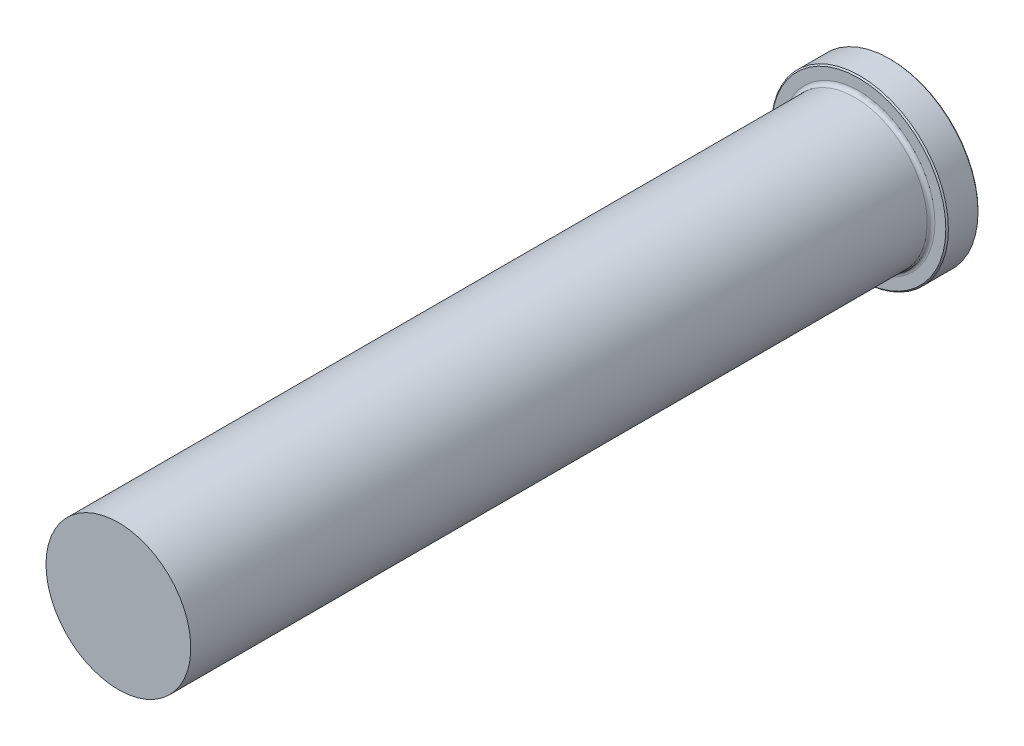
ISO-10303-21;
HEADER;
FILE_DESCRIPTION(('STEP AP214'),'2;1');
FILE_NAME('part.step','',(''),(''),'','','');
FILE_SCHEMA(('AUTOMOTIVE_DESIGN { 1 0 10303 214 1 1 1 1 }'));
ENDSEC;
DATA;
#1=APPLICATION_CONTEXT('core data for automotive mechanical design processes');
#2=APPLICATION_PROTOCOL_DEFINITION('international standard','automotive_design',2000,#1);
#3=PRODUCT_CONTEXT('',#1,'mechanical');
#4=PRODUCT('Part','Part','',(#3));
#5=PRODUCT_RELATED_PRODUCT_CATEGORY('part','',(#4));
#6=PRODUCT_DEFINITION_FORMATION('','',#4);
#7=PRODUCT_DEFINITION_CONTEXT('part definition',#1,'design');
#8=PRODUCT_DEFINITION('design','',#6,#7);
#9=PRODUCT_DEFINITION_SHAPE('','',#8);
#10=(LENGTH_UNIT() NAMED_UNIT(*) SI_UNIT(.MILLI.,.METRE.));
#11=(NAMED_UNIT(*) PLANE_ANGLE_UNIT() SI_UNIT($,.RADIAN.));
#12=(NAMED_UNIT(*) SI_UNIT($,.STERADIAN.) SOLID_ANGLE_UNIT());
#13=UNCERTAINTY_MEASURE_WITH_UNIT(LENGTH_MEASURE(1.E-05),#10,'distance_accuracy_value','');
#14=(GEOMETRIC_REPRESENTATION_CONTEXT(3) GLOBAL_UNCERTAINTY_ASSIGNED_CONTEXT((#13)) GLOBAL_UNIT_ASSIGNED_CONTEXT((#10,
#11,#12)) REPRESENTATION_CONTEXT('',''));
#15=CARTESIAN_POINT('',(0.,0.,0.));
#16=DIRECTION('',(0.,0.,1.));
#17=DIRECTION('',(1.,0.,0.));
#18=AXIS2_PLACEMENT_3D('',#15,#16,#17);
#19=CARTESIAN_POINT('',(0.,0.,0.));
#20=DIRECTION('',(0.,0.,-1.));
#21=DIRECTION('',(-1.,0.,0.));
#22=AXIS2_PLACEMENT_3D('',#19,#20,#21);
#23=PLANE('',#22);
#24=CARTESIAN_POINT('',(0.,0.,0.));
#25=DIRECTION('',(0.,0.,-1.));
#26=DIRECTION('',(-1.,0.,0.));
#27=AXIS2_PLACEMENT_3D('',#24,#25,#26);
#28=CIRCLE('',#27,17.2085);
#29=CARTESIAN_POINT('',(-17.2085,0.,0.));
#30=VERTEX_POINT('',#29);
#31=EDGE_CURVE('E50',#30,#30,#28,.T.);
#32=ORIENTED_EDGE('',*,*,#31,.T.);
#33=EDGE_LOOP('',(#32));
#34=FACE_BOUND('',#33,.T.);
#35=ADVANCED_FACE('F35',(#34),#23,.T.);
#36=CARTESIAN_POINT('',(0.,0.,0.));
#37=DIRECTION('',(0.,0.,-1.));
#38=DIRECTION('',(-1.,0.,0.));
#39=AXIS2_PLACEMENT_3D('',#36,#37,#38);
#40=CYLINDRICAL_SURFACE('',#39,17.4625);
#41=CARTESIAN_POINT('',(0.,0.,0.254000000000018));
#42=DIRECTION('',(0.,0.,-1.));
#43=DIRECTION('',(-1.,0.,0.));
#44=AXIS2_PLACEMENT_3D('',#41,#42,#43);
#45=CIRCLE('',#44,17.4625);
#46=CARTESIAN_POINT('',(-17.4625,0.,0.254000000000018));
#47=VERTEX_POINT('',#46);
#48=EDGE_CURVE('E42',#47,#47,#45,.F.);
#49=ORIENTED_EDGE('',*,*,#48,.T.);
#50=EDGE_LOOP('',(#49));
#51=FACE_BOUND('',#50,.T.);
#52=CARTESIAN_POINT('',(0.,0.,6.09600000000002));
#53=DIRECTION('',(0.,0.,1.));
#54=DIRECTION('',(1.,0.,0.));
#55=AXIS2_PLACEMENT_3D('',#52,#53,#54);
#56=CIRCLE('',#55,17.4625);
#57=CARTESIAN_POINT('',(17.4625,0.,6.09600000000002));
#58=VERTEX_POINT('',#57);
#59=EDGE_CURVE('E46',#58,#58,#56,.F.);
#60=ORIENTED_EDGE('',*,*,#59,.T.);
#61=EDGE_LOOP('',(#60));
#62=FACE_BOUND('',#61,.T.);
#63=ADVANCED_FACE('F82',(#51,#62),#40,.T.);
#64=CARTESIAN_POINT('',(0.,17.4625,6.35));
#65=DIRECTION('',(0.,0.,1.));
#66=DIRECTION('',(1.,0.,0.));
#67=AXIS2_PLACEMENT_3D('',#64,#65,#66);
#68=PLANE('',#67);
#69=CARTESIAN_POINT('',(0.,0.,6.35));
#70=DIRECTION('',(0.,0.,1.));
#71=DIRECTION('',(1.,0.,0.));
#72=AXIS2_PLACEMENT_3D('',#69,#70,#71);
#73=CIRCLE('',#72,17.2085);
#74=CARTESIAN_POINT('',(17.2085,0.,6.35));
#75=VERTEX_POINT('',#74);
#76=EDGE_CURVE('E10',#75,#75,#73,.T.);
#77=ORIENTED_EDGE('',*,*,#76,.T.);
#78=EDGE_LOOP('',(#77));
#79=FACE_BOUND('',#78,.T.);
#80=CARTESIAN_POINT('',(0.,0.,6.35));
#81=DIRECTION('',(0.,0.,1.));
#82=DIRECTION('',(1.,0.,0.));
#83=AXIS2_PLACEMENT_3D('',#80,#81,#82);
#84=CIRCLE('',#83,15.0495);
#85=CARTESIAN_POINT('',(15.0495,0.,6.35));
#86=VERTEX_POINT('',#85);
#87=EDGE_CURVE('E58',#86,#86,#84,.F.);
#88=ORIENTED_EDGE('',*,*,#87,.T.);
#89=EDGE_LOOP('',(#88));
#90=FACE_BOUND('',#89,.T.);
#91=ADVANCED_FACE('F78',(#79,#90),#68,.T.);
#92=CARTESIAN_POINT('',(0.,0.,0.));
#93=DIRECTION('',(0.,0.,-1.));
#94=DIRECTION('',(-1.,0.,0.));
#95=AXIS2_PLACEMENT_3D('',#92,#93,#94);
#96=CYLINDRICAL_SURFACE('',#95,14.2875);
#97=CARTESIAN_POINT('',(0.,0.,7.112));
#98=DIRECTION('',(0.,0.,1.));
#99=DIRECTION('',(1.,0.,0.));
#100=AXIS2_PLACEMENT_3D('',#97,#98,#99);
#101=CIRCLE('',#100,14.2875);
#102=CARTESIAN_POINT('',(14.2875,0.,7.112));
#103=VERTEX_POINT('',#102);
#104=EDGE_CURVE('E55',#103,#103,#101,.T.);
#105=ORIENTED_EDGE('',*,*,#104,.T.);
#106=EDGE_LOOP('',(#105));
#107=FACE_BOUND('',#106,.T.);
#108=CARTESIAN_POINT('',(0.,0.,152.4));
#109=DIRECTION('',(0.,0.,-1.));
#110=DIRECTION('',(-1.,0.,0.));
#111=AXIS2_PLACEMENT_3D('',#108,#109,#110);
#112=CIRCLE('',#111,14.2875);
#113=CARTESIAN_POINT('',(-14.2875,0.,152.4));
#114=VERTEX_POINT('',#113);
#115=EDGE_CURVE('E61',#114,#114,#112,.T.);
#116=ORIENTED_EDGE('',*,*,#115,.T.);
#117=EDGE_LOOP('',(#116));
#118=FACE_BOUND('',#117,.T.);
#119=ADVANCED_FACE('F65',(#107,#118),#96,.T.);
#120=CARTESIAN_POINT('',(0.,14.2875,152.4));
#121=DIRECTION('',(0.,0.,1.));
#122=DIRECTION('',(1.,0.,0.));
#123=AXIS2_PLACEMENT_3D('',#120,#121,#122);
#124=PLANE('',#123);
#125=ORIENTED_EDGE('',*,*,#115,.F.);
#126=EDGE_LOOP('',(#125));
#127=FACE_BOUND('',#126,.T.);
#128=ADVANCED_FACE('F67',(#127),#124,.T.);
#129=CARTESIAN_POINT('',(0.,0.,7.112));
#130=DIRECTION('',(0.,0.,1.));
#131=DIRECTION('',(1.,0.,0.));
#132=AXIS2_PLACEMENT_3D('',#129,#130,#131);
#133=TOROIDAL_SURFACE('',#132,15.0495,0.762);
#134=ORIENTED_EDGE('',*,*,#104,.F.);
#135=EDGE_LOOP('',(#134));
#136=FACE_BOUND('',#135,.T.);
#137=ORIENTED_EDGE('',*,*,#87,.F.);
#138=EDGE_LOOP('',(#137));
#139=FACE_BOUND('',#138,.T.);
#140=ADVANCED_FACE('F69',(#136,#139),#133,.F.);
#141=CARTESIAN_POINT('',(0.,0.,0.));
#142=DIRECTION('',(0.,0.,1.));
#143=DIRECTION('',(1.,0.,0.));
#144=AXIS2_PLACEMENT_3D('',#141,#142,#143);
#145=CONICAL_SURFACE('',#144,17.2085,0.785398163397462);
#146=ORIENTED_EDGE('',*,*,#48,.F.);
#147=EDGE_LOOP('',(#146));
#148=FACE_BOUND('',#147,.T.);
#149=ORIENTED_EDGE('',*,*,#31,.F.);
#150=EDGE_LOOP('',(#149));
#151=FACE_BOUND('',#150,.T.);
#152=ADVANCED_FACE('F75',(#148,#151),#145,.T.);
#153=CARTESIAN_POINT('',(0.,0.,6.09600000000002));
#154=DIRECTION('',(0.,0.,-1.));
#155=DIRECTION('',(-1.,0.,0.));
#156=AXIS2_PLACEMENT_3D('',#153,#154,#155);
#157=CONICAL_SURFACE('',#156,17.4625,0.785398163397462);
#158=ORIENTED_EDGE('',*,*,#76,.F.);
#159=EDGE_LOOP('',(#158));
#160=FACE_BOUND('',#159,.T.);
#161=ORIENTED_EDGE('',*,*,#59,.F.);
#162=EDGE_LOOP('',(#161));
#163=FACE_BOUND('',#162,.T.);
#164=ADVANCED_FACE('F37',(#160,#163),#157,.T.);
#165=CLOSED_SHELL('',(#35,#63,#91,#119,#128,#140,#152,#164));
#166=MANIFOLD_SOLID_BREP('B2',#165);
#167=ADVANCED_BREP_SHAPE_REPRESENTATION('',(#18,#166),#14);
#168=SHAPE_DEFINITION_REPRESENTATION(#9,#167);
ENDSEC;
END-ISO-10303-21;
